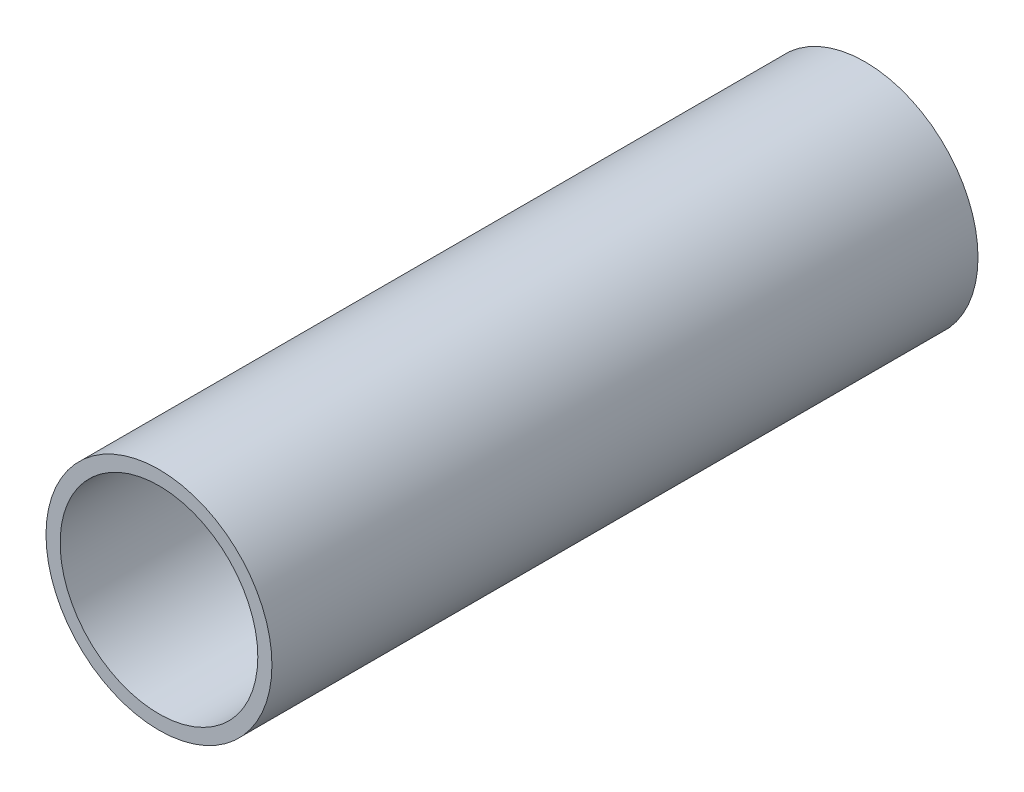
from build123d import *

# Parameters (mm, degrees)
ESQUISSE1_R        = 16
ESQUISSE1_R_2      = 14
BOSS_EXTRU_1_DEPTH = 100


with BuildPart() as part:
    # Esquisse1 → Boss.-Extru.1 (new body)
    with BuildSketch(Plane.XY):
        Circle(ESQUISSE1_R)
        Circle(ESQUISSE1_R_2, mode=Mode.SUBTRACT)
    extrude(amount=BOSS_EXTRU_1_DEPTH)


solid = part.part
